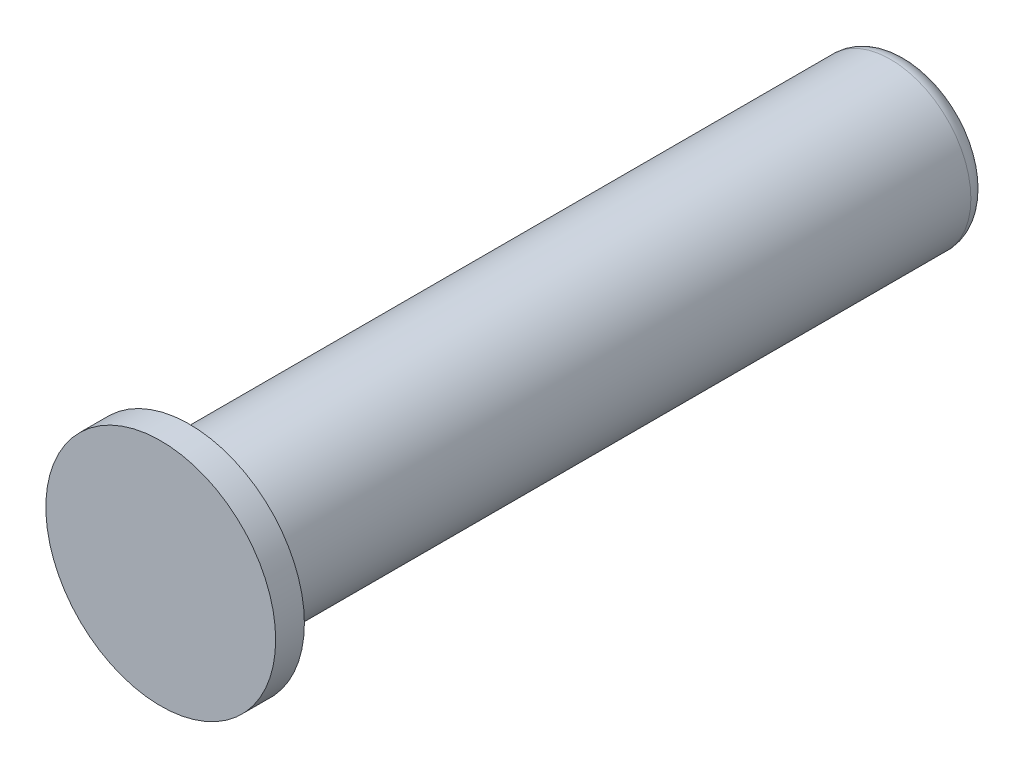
ISO-10303-21;
HEADER;
FILE_DESCRIPTION(('STEP AP214'),'2;1');
FILE_NAME('part.step','',(''),(''),'','','');
FILE_SCHEMA(('AUTOMOTIVE_DESIGN { 1 0 10303 214 1 1 1 1 }'));
ENDSEC;
DATA;
#1=APPLICATION_CONTEXT('core data for automotive mechanical design processes');
#2=APPLICATION_PROTOCOL_DEFINITION('international standard','automotive_design',2000,#1);
#3=PRODUCT_CONTEXT('',#1,'mechanical');
#4=PRODUCT('Part','Part','',(#3));
#5=PRODUCT_RELATED_PRODUCT_CATEGORY('part','',(#4));
#6=PRODUCT_DEFINITION_FORMATION('','',#4);
#7=PRODUCT_DEFINITION_CONTEXT('part definition',#1,'design');
#8=PRODUCT_DEFINITION('design','',#6,#7);
#9=PRODUCT_DEFINITION_SHAPE('','',#8);
#10=(LENGTH_UNIT() NAMED_UNIT(*) SI_UNIT(.MILLI.,.METRE.));
#11=(NAMED_UNIT(*) PLANE_ANGLE_UNIT() SI_UNIT($,.RADIAN.));
#12=(NAMED_UNIT(*) SI_UNIT($,.STERADIAN.) SOLID_ANGLE_UNIT());
#13=UNCERTAINTY_MEASURE_WITH_UNIT(LENGTH_MEASURE(1.E-05),#10,'distance_accuracy_value','');
#14=(GEOMETRIC_REPRESENTATION_CONTEXT(3) GLOBAL_UNCERTAINTY_ASSIGNED_CONTEXT((#13)) GLOBAL_UNIT_ASSIGNED_CONTEXT((#10,
#11,#12)) REPRESENTATION_CONTEXT('',''));
#15=CARTESIAN_POINT('',(0.,0.,0.));
#16=DIRECTION('',(0.,0.,1.));
#17=DIRECTION('',(1.,0.,0.));
#18=AXIS2_PLACEMENT_3D('',#15,#16,#17);
#19=CARTESIAN_POINT('',(0.,0.,0.));
#20=DIRECTION('',(0.,0.,-1.));
#21=DIRECTION('',(-1.,0.,0.));
#22=AXIS2_PLACEMENT_3D('',#19,#20,#21);
#23=PLANE('',#22);
#24=CARTESIAN_POINT('',(0.,0.,0.));
#25=DIRECTION('',(0.,0.,1.));
#26=DIRECTION('',(1.,0.,0.));
#27=AXIS2_PLACEMENT_3D('',#24,#25,#26);
#28=CIRCLE('',#27,20.);
#29=CARTESIAN_POINT('',(20.,0.,0.));
#30=VERTEX_POINT('',#29);
#31=EDGE_CURVE('E11',#30,#30,#28,.T.);
#32=ORIENTED_EDGE('',*,*,#31,.T.);
#33=EDGE_LOOP('',(#32));
#34=FACE_BOUND('',#33,.T.);
#35=ADVANCED_FACE('F32',(#34),#23,.F.);
#36=CARTESIAN_POINT('',(0.,0.,0.));
#37=DIRECTION('',(0.,0.,1.));
#38=DIRECTION('',(1.,0.,0.));
#39=AXIS2_PLACEMENT_3D('',#36,#37,#38);
#40=CYLINDRICAL_SURFACE('',#39,20.);
#41=ORIENTED_EDGE('',*,*,#31,.F.);
#42=EDGE_LOOP('',(#41));
#43=FACE_BOUND('',#42,.T.);
#44=CARTESIAN_POINT('',(0.,0.,-5.));
#45=DIRECTION('',(0.,0.,1.));
#46=DIRECTION('',(1.,0.,0.));
#47=AXIS2_PLACEMENT_3D('',#44,#45,#46);
#48=CIRCLE('',#47,20.);
#49=CARTESIAN_POINT('',(20.,0.,-5.));
#50=VERTEX_POINT('',#49);
#51=EDGE_CURVE('E38',#50,#50,#48,.T.);
#52=ORIENTED_EDGE('',*,*,#51,.T.);
#53=EDGE_LOOP('',(#52));
#54=FACE_BOUND('',#53,.T.);
#55=ADVANCED_FACE('F54',(#43,#54),#40,.T.);
#56=CARTESIAN_POINT('',(0.,20.,-5.));
#57=DIRECTION('',(0.,0.,1.));
#58=DIRECTION('',(1.,0.,0.));
#59=AXIS2_PLACEMENT_3D('',#56,#57,#58);
#60=PLANE('',#59);
#61=ORIENTED_EDGE('',*,*,#51,.F.);
#62=EDGE_LOOP('',(#61));
#63=FACE_BOUND('',#62,.T.);
#64=CARTESIAN_POINT('',(0.,0.,-5.));
#65=DIRECTION('',(0.,0.,1.));
#66=DIRECTION('',(1.,0.,0.));
#67=AXIS2_PLACEMENT_3D('',#64,#65,#66);
#68=CIRCLE('',#67,14.);
#69=CARTESIAN_POINT('',(14.,0.,-5.));
#70=VERTEX_POINT('',#69);
#71=EDGE_CURVE('E66',#70,#70,#68,.T.);
#72=ORIENTED_EDGE('',*,*,#71,.T.);
#73=EDGE_LOOP('',(#72));
#74=FACE_BOUND('',#73,.T.);
#75=ADVANCED_FACE('F59',(#63,#74),#60,.F.);
#76=CARTESIAN_POINT('',(0.,0.,0.));
#77=DIRECTION('',(0.,0.,1.));
#78=DIRECTION('',(1.,0.,0.));
#79=AXIS2_PLACEMENT_3D('',#76,#77,#78);
#80=CYLINDRICAL_SURFACE('',#79,14.);
#81=ORIENTED_EDGE('',*,*,#71,.F.);
#82=EDGE_LOOP('',(#81));
#83=FACE_BOUND('',#82,.T.);
#84=CARTESIAN_POINT('',(0.,0.,-127.));
#85=DIRECTION('',(0.,0.,1.));
#86=DIRECTION('',(1.,0.,0.));
#87=AXIS2_PLACEMENT_3D('',#84,#85,#86);
#88=CIRCLE('',#87,14.);
#89=CARTESIAN_POINT('',(14.,0.,-127.));
#90=VERTEX_POINT('',#89);
#91=EDGE_CURVE('E68',#90,#90,#88,.T.);
#92=ORIENTED_EDGE('',*,*,#91,.T.);
#93=EDGE_LOOP('',(#92));
#94=FACE_BOUND('',#93,.T.);
#95=ADVANCED_FACE('F101',(#83,#94),#80,.T.);
#96=CARTESIAN_POINT('',(0.,0.,-127.));
#97=DIRECTION('',(0.,0.,1.));
#98=DIRECTION('',(1.,0.,0.));
#99=AXIS2_PLACEMENT_3D('',#96,#97,#98);
#100=TOROIDAL_SURFACE('',#99,11.,3.);
#101=ORIENTED_EDGE('',*,*,#91,.F.);
#102=EDGE_LOOP('',(#101));
#103=FACE_BOUND('',#102,.T.);
#104=CARTESIAN_POINT('',(0.,0.,-130.));
#105=DIRECTION('',(0.,0.,1.));
#106=DIRECTION('',(1.,0.,0.));
#107=AXIS2_PLACEMENT_3D('',#104,#105,#106);
#108=CIRCLE('',#107,11.);
#109=CARTESIAN_POINT('',(11.,0.,-130.));
#110=VERTEX_POINT('',#109);
#111=EDGE_CURVE('E73',#110,#110,#108,.T.);
#112=ORIENTED_EDGE('',*,*,#111,.T.);
#113=EDGE_LOOP('',(#112));
#114=FACE_BOUND('',#113,.T.);
#115=ADVANCED_FACE('F94',(#103,#114),#100,.T.);
#116=CARTESIAN_POINT('',(0.,11.,-130.));
#117=DIRECTION('',(0.,0.,1.));
#118=DIRECTION('',(1.,0.,0.));
#119=AXIS2_PLACEMENT_3D('',#116,#117,#118);
#120=PLANE('',#119);
#121=ORIENTED_EDGE('',*,*,#111,.F.);
#122=EDGE_LOOP('',(#121));
#123=FACE_BOUND('',#122,.T.);
#124=CARTESIAN_POINT('',(0.,0.,-130.));
#125=DIRECTION('',(0.,0.,1.));
#126=DIRECTION('',(1.,0.,0.));
#127=AXIS2_PLACEMENT_3D('',#124,#125,#126);
#128=CIRCLE('',#127,3.50000000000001);
#129=CARTESIAN_POINT('',(3.50000000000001,0.,-130.));
#130=VERTEX_POINT('',#129);
#131=EDGE_CURVE('E76',#130,#130,#128,.T.);
#132=ORIENTED_EDGE('',*,*,#131,.T.);
#133=EDGE_LOOP('',(#132));
#134=FACE_BOUND('',#133,.T.);
#135=ADVANCED_FACE('F88',(#123,#134),#120,.F.);
#136=CARTESIAN_POINT('',(0.,0.,-129.5));
#137=DIRECTION('',(0.,0.,-1.));
#138=DIRECTION('',(-1.,0.,0.));
#139=AXIS2_PLACEMENT_3D('',#136,#137,#138);
#140=CONICAL_SURFACE('',#139,3.,0.785398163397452);
#141=ORIENTED_EDGE('',*,*,#131,.F.);
#142=EDGE_LOOP('',(#141));
#143=FACE_BOUND('',#142,.T.);
#144=CARTESIAN_POINT('',(0.,0.,-129.5));
#145=DIRECTION('',(0.,0.,1.));
#146=DIRECTION('',(1.,0.,0.));
#147=AXIS2_PLACEMENT_3D('',#144,#145,#146);
#148=CIRCLE('',#147,3.);
#149=CARTESIAN_POINT('',(3.,0.,-129.5));
#150=VERTEX_POINT('',#149);
#151=EDGE_CURVE('E79',#150,#150,#148,.T.);
#152=ORIENTED_EDGE('',*,*,#151,.T.);
#153=EDGE_LOOP('',(#152));
#154=FACE_BOUND('',#153,.T.);
#155=ADVANCED_FACE('F49',(#143,#154),#140,.F.);
#156=CARTESIAN_POINT('',(0.,0.,0.));
#157=DIRECTION('',(0.,0.,1.));
#158=DIRECTION('',(1.,0.,0.));
#159=AXIS2_PLACEMENT_3D('',#156,#157,#158);
#160=CYLINDRICAL_SURFACE('',#159,3.);
#161=ORIENTED_EDGE('',*,*,#151,.F.);
#162=EDGE_LOOP('',(#161));
#163=FACE_BOUND('',#162,.T.);
#164=CARTESIAN_POINT('',(0.,0.,-121.));
#165=DIRECTION('',(0.,0.,1.));
#166=DIRECTION('',(1.,0.,0.));
#167=AXIS2_PLACEMENT_3D('',#164,#165,#166);
#168=CIRCLE('',#167,3.);
#169=CARTESIAN_POINT('',(3.,0.,-121.));
#170=VERTEX_POINT('',#169);
#171=EDGE_CURVE('E82',#170,#170,#168,.T.);
#172=ORIENTED_EDGE('',*,*,#171,.T.);
#173=EDGE_LOOP('',(#172));
#174=FACE_BOUND('',#173,.T.);
#175=ADVANCED_FACE('F43',(#163,#174),#160,.F.);
#176=CARTESIAN_POINT('',(0.,0.,-119.267949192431));
#177=DIRECTION('',(0.,0.,-1.));
#178=DIRECTION('',(-1.,0.,0.));
#179=AXIS2_PLACEMENT_3D('',#176,#177,#178);
#180=CONICAL_SURFACE('',#179,0.,1.0471975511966);
#181=ORIENTED_EDGE('',*,*,#171,.F.);
#182=EDGE_LOOP('',(#181));
#183=FACE_BOUND('',#182,.T.);
#184=CARTESIAN_POINT('',(0.,0.,-119.267949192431));
#185=VERTEX_POINT('',#184);
#186=VERTEX_LOOP('',#185);
#187=FACE_BOUND('',#186,.T.);
#188=ADVANCED_FACE('F41',(#183,#187),#180,.F.);
#189=CLOSED_SHELL('',(#35,#55,#75,#95,#115,#135,#155,#175,#188));
#190=MANIFOLD_SOLID_BREP('B2',#189);
#191=ADVANCED_BREP_SHAPE_REPRESENTATION('',(#18,#190),#14);
#192=SHAPE_DEFINITION_REPRESENTATION(#9,#191);
ENDSEC;
END-ISO-10303-21;
